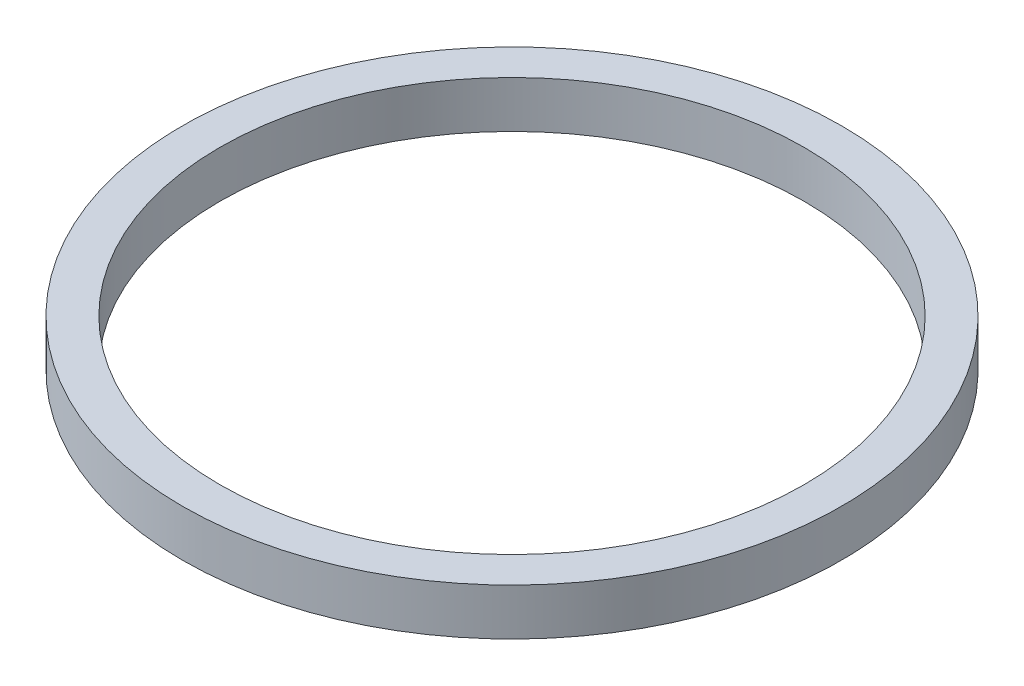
from build123d import *

# Parameters (mm, degrees)
SKETCH1_R           = 14.1
BOSS_EXTRUDE1_DEPTH = 2
SKETCH2_R           = 12.5
CUT_EXTRUDE1_DEPTH  = 21.040459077


with BuildPart() as part:
    # Sketch1 → Boss-Extrude1 (new body)
    with BuildSketch(Plane(origin=(0, 0, 0), x_dir=(1, 0, 0), z_dir=(0, 1, 0))):
        with Locations(Location((0, 0, 0), (0, 0, 270))):
            Circle(SKETCH1_R)
    extrude(amount=BOSS_EXTRUDE1_DEPTH)

    # Sketch2 → Cut-Extrude1 (cut, through all)
    with BuildSketch(Plane(origin=(0, 2, 0), x_dir=(1, 0, 0), z_dir=(0, 1, 0))):
        with Locations(Location((0, 0, 0), (0, 0, 270))):
            Circle(SKETCH2_R)
    extrude(amount=-CUT_EXTRUDE1_DEPTH, mode=Mode.SUBTRACT)


solid = part.part
